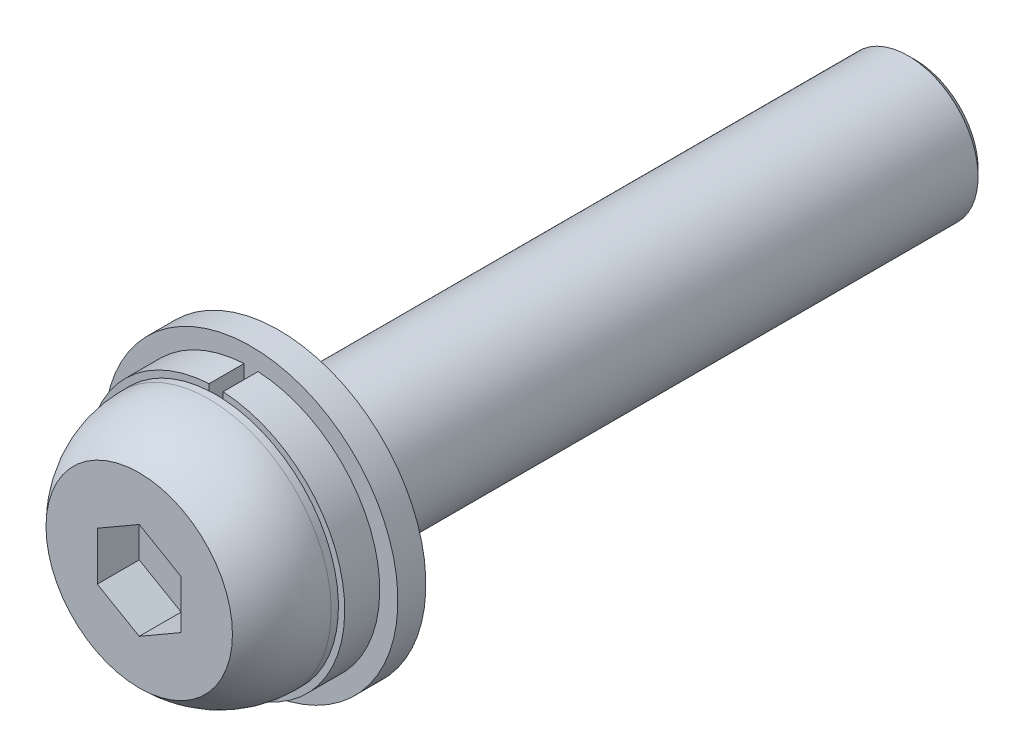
ISO-10303-21;
HEADER;
FILE_DESCRIPTION(('STEP AP214'),'2;1');
FILE_NAME('part.step','',(''),(''),'','','');
FILE_SCHEMA(('AUTOMOTIVE_DESIGN { 1 0 10303 214 1 1 1 1 }'));
ENDSEC;
DATA;
#1=APPLICATION_CONTEXT('core data for automotive mechanical design processes');
#2=APPLICATION_PROTOCOL_DEFINITION('international standard','automotive_design',2000,#1);
#3=PRODUCT_CONTEXT('',#1,'mechanical');
#4=PRODUCT('Part','Part','',(#3));
#5=PRODUCT_RELATED_PRODUCT_CATEGORY('part','',(#4));
#6=PRODUCT_DEFINITION_FORMATION('','',#4);
#7=PRODUCT_DEFINITION_CONTEXT('part definition',#1,'design');
#8=PRODUCT_DEFINITION('design','',#6,#7);
#9=PRODUCT_DEFINITION_SHAPE('','',#8);
#10=(LENGTH_UNIT() NAMED_UNIT(*) SI_UNIT(.MILLI.,.METRE.));
#11=(NAMED_UNIT(*) PLANE_ANGLE_UNIT() SI_UNIT($,.RADIAN.));
#12=(NAMED_UNIT(*) SI_UNIT($,.STERADIAN.) SOLID_ANGLE_UNIT());
#13=UNCERTAINTY_MEASURE_WITH_UNIT(LENGTH_MEASURE(1.E-05),#10,'distance_accuracy_value','');
#14=(GEOMETRIC_REPRESENTATION_CONTEXT(3) GLOBAL_UNCERTAINTY_ASSIGNED_CONTEXT((#13)) GLOBAL_UNIT_ASSIGNED_CONTEXT((#10,
#11,#12)) REPRESENTATION_CONTEXT('',''));
#15=CARTESIAN_POINT('',(0.,0.,0.));
#16=DIRECTION('',(0.,0.,1.));
#17=DIRECTION('',(1.,0.,0.));
#18=AXIS2_PLACEMENT_3D('',#15,#16,#17);
#19=CARTESIAN_POINT('',(0.,0.,2.));
#20=DIRECTION('',(0.,0.,1.));
#21=DIRECTION('',(-1.,0.,0.));
#22=AXIS2_PLACEMENT_3D('',#19,#20,#21);
#23=PLANE('',#22);
#24=DIRECTION('',(0.,1.,0.));
#25=VECTOR('',#24,1.);
#26=CARTESIAN_POINT('',(-0.5,5.07543101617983,2.));
#27=LINE('',#26,#25);
#28=CARTESIAN_POINT('',(-0.5,5.22613624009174,2.));
#29=VERTEX_POINT('',#28);
#30=CARTESIAN_POINT('',(-0.5,9.18640299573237,2.));
#31=VERTEX_POINT('',#30);
#32=EDGE_CURVE('E9',#29,#31,#27,.T.);
#33=ORIENTED_EDGE('',*,*,#32,.F.);
#34=CARTESIAN_POINT('',(0.,0.,2.));
#35=DIRECTION('',(0.,0.,1.));
#36=DIRECTION('',(-1.,0.,0.));
#37=AXIS2_PLACEMENT_3D('',#34,#35,#36);
#38=CIRCLE('',#37,5.25);
#39=CARTESIAN_POINT('',(0.5,5.22613624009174,2.));
#40=VERTEX_POINT('',#39);
#41=EDGE_CURVE('E184',#40,#29,#38,.T.);
#42=ORIENTED_EDGE('',*,*,#41,.F.);
#43=DIRECTION('',(0.,-1.,0.));
#44=VECTOR('',#43,1.);
#45=CARTESIAN_POINT('',(0.5,5.07543101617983,2.));
#46=LINE('',#45,#44);
#47=CARTESIAN_POINT('',(0.5,9.18640299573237,2.));
#48=VERTEX_POINT('',#47);
#49=EDGE_CURVE('E167',#48,#40,#46,.T.);
#50=ORIENTED_EDGE('',*,*,#49,.F.);
#51=CARTESIAN_POINT('',(0.,0.,2.));
#52=DIRECTION('',(0.,0.,1.));
#53=DIRECTION('',(1.,0.,0.));
#54=AXIS2_PLACEMENT_3D('',#51,#52,#53);
#55=CIRCLE('',#54,9.2);
#56=EDGE_CURVE('E24',#31,#48,#55,.T.);
#57=ORIENTED_EDGE('',*,*,#56,.F.);
#58=EDGE_LOOP('',(#33,#42,#50,#57));
#59=FACE_BOUND('',#58,.T.);
#60=CARTESIAN_POINT('',(0.,0.,2.));
#61=DIRECTION('',(0.,0.,1.));
#62=DIRECTION('',(-1.,0.,0.));
#63=AXIS2_PLACEMENT_3D('',#60,#61,#62);
#64=CIRCLE('',#63,10.5);
#65=CARTESIAN_POINT('',(-10.5,0.,2.));
#66=VERTEX_POINT('',#65);
#67=EDGE_CURVE('E175',#66,#66,#64,.T.);
#68=ORIENTED_EDGE('',*,*,#67,.T.);
#69=EDGE_LOOP('',(#68));
#70=FACE_BOUND('',#69,.T.);
#71=ADVANCED_FACE('F14',(#59,#70),#23,.T.);
#72=CARTESIAN_POINT('',(0.,0.,0.));
#73=DIRECTION('',(0.,0.,1.));
#74=DIRECTION('',(-1.,0.,0.));
#75=AXIS2_PLACEMENT_3D('',#72,#73,#74);
#76=PLANE('',#75);
#77=CARTESIAN_POINT('',(0.,0.,0.));
#78=DIRECTION('',(0.,0.,1.));
#79=DIRECTION('',(-1.,0.,0.));
#80=AXIS2_PLACEMENT_3D('',#77,#78,#79);
#81=CIRCLE('',#80,10.5);
#82=CARTESIAN_POINT('',(-10.5,0.,0.));
#83=VERTEX_POINT('',#82);
#84=EDGE_CURVE('E179',#83,#83,#81,.T.);
#85=ORIENTED_EDGE('',*,*,#84,.F.);
#86=EDGE_LOOP('',(#85));
#87=FACE_BOUND('',#86,.T.);
#88=CARTESIAN_POINT('',(0.,0.,0.));
#89=DIRECTION('',(0.,0.,1.));
#90=DIRECTION('',(-1.,0.,0.));
#91=AXIS2_PLACEMENT_3D('',#88,#89,#90);
#92=CIRCLE('',#91,5.25);
#93=CARTESIAN_POINT('',(-5.25,0.,0.));
#94=VERTEX_POINT('',#93);
#95=EDGE_CURVE('E187',#94,#94,#92,.T.);
#96=ORIENTED_EDGE('',*,*,#95,.T.);
#97=EDGE_LOOP('',(#96));
#98=FACE_BOUND('',#97,.T.);
#99=ADVANCED_FACE('F300',(#87,#98),#76,.F.);
#100=CARTESIAN_POINT('',(0.,0.,2.));
#101=DIRECTION('',(0.,0.,-1.));
#102=DIRECTION('',(1.,0.,0.));
#103=AXIS2_PLACEMENT_3D('',#100,#101,#102);
#104=CYLINDRICAL_SURFACE('',#103,10.5);
#105=ORIENTED_EDGE('',*,*,#67,.F.);
#106=EDGE_LOOP('',(#105));
#107=FACE_BOUND('',#106,.T.);
#108=ORIENTED_EDGE('',*,*,#84,.T.);
#109=EDGE_LOOP('',(#108));
#110=FACE_BOUND('',#109,.T.);
#111=ADVANCED_FACE('F296',(#107,#110),#104,.T.);
#112=CARTESIAN_POINT('',(0.,0.,2.));
#113=DIRECTION('',(0.,0.,-1.));
#114=DIRECTION('',(1.,0.,0.));
#115=AXIS2_PLACEMENT_3D('',#112,#113,#114);
#116=CYLINDRICAL_SURFACE('',#115,5.25);
#117=ORIENTED_EDGE('',*,*,#41,.T.);
#118=EDGE_CURVE('E337',#29,#40,#38,.T.);
#119=ORIENTED_EDGE('',*,*,#118,.T.);
#120=EDGE_LOOP('',(#117,#119));
#121=FACE_BOUND('',#120,.T.);
#122=ORIENTED_EDGE('',*,*,#95,.F.);
#123=EDGE_LOOP('',(#122));
#124=FACE_BOUND('',#123,.T.);
#125=ADVANCED_FACE('F289',(#121,#124),#116,.F.);
#126=CARTESIAN_POINT('',(3.,-5.19615242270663,7.));
#127=DIRECTION('',(0.,0.,1.));
#128=DIRECTION('',(-1.,0.,0.));
#129=AXIS2_PLACEMENT_3D('',#126,#127,#128);
#130=PLANE('',#129);
#131=DIRECTION('',(0.866025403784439,-0.5,0.));
#132=VECTOR('',#131,1.);
#133=CARTESIAN_POINT('',(-3.,-1.73205080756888,7.));
#134=LINE('',#133,#132);
#135=CARTESIAN_POINT('',(-3.,-1.73205080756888,7.));
#136=VERTEX_POINT('',#135);
#137=CARTESIAN_POINT('',(0.,-3.46410161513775,7.));
#138=VERTEX_POINT('',#137);
#139=EDGE_CURVE('E104',#136,#138,#134,.T.);
#140=ORIENTED_EDGE('',*,*,#139,.T.);
#141=DIRECTION('',(0.866025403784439,0.5,0.));
#142=VECTOR('',#141,1.);
#143=CARTESIAN_POINT('',(0.,-3.46410161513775,7.));
#144=LINE('',#143,#142);
#145=CARTESIAN_POINT('',(3.,-1.73205080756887,7.));
#146=VERTEX_POINT('',#145);
#147=EDGE_CURVE('E230',#138,#146,#144,.T.);
#148=ORIENTED_EDGE('',*,*,#147,.T.);
#149=DIRECTION('',(0.,1.,0.));
#150=VECTOR('',#149,1.);
#151=CARTESIAN_POINT('',(3.,-1.73205080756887,7.));
#152=LINE('',#151,#150);
#153=CARTESIAN_POINT('',(3.,1.73205080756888,7.));
#154=VERTEX_POINT('',#153);
#155=EDGE_CURVE('E233',#146,#154,#152,.T.);
#156=ORIENTED_EDGE('',*,*,#155,.T.);
#157=DIRECTION('',(-0.866025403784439,0.5,0.));
#158=VECTOR('',#157,1.);
#159=CARTESIAN_POINT('',(3.,1.73205080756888,7.));
#160=LINE('',#159,#158);
#161=CARTESIAN_POINT('',(0.,3.46410161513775,7.));
#162=VERTEX_POINT('',#161);
#163=EDGE_CURVE('E236',#154,#162,#160,.T.);
#164=ORIENTED_EDGE('',*,*,#163,.T.);
#165=DIRECTION('',(-0.866025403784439,-0.5,0.));
#166=VECTOR('',#165,1.);
#167=CARTESIAN_POINT('',(0.,3.46410161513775,7.));
#168=LINE('',#167,#166);
#169=CARTESIAN_POINT('',(-3.,1.73205080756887,7.));
#170=VERTEX_POINT('',#169);
#171=EDGE_CURVE('E238',#162,#170,#168,.T.);
#172=ORIENTED_EDGE('',*,*,#171,.T.);
#173=DIRECTION('',(0.,-1.,0.));
#174=VECTOR('',#173,1.);
#175=CARTESIAN_POINT('',(-3.,1.73205080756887,7.));
#176=LINE('',#175,#174);
#177=EDGE_CURVE('E129',#170,#136,#176,.T.);
#178=ORIENTED_EDGE('',*,*,#177,.T.);
#179=EDGE_LOOP('',(#140,#148,#156,#164,#172,#178));
#180=FACE_BOUND('',#179,.T.);
#181=ADVANCED_FACE('F242',(#180),#130,.T.);
#182=CARTESIAN_POINT('',(3.,-1.73205080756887,7.));
#183=DIRECTION('',(1.,0.,0.));
#184=DIRECTION('',(0.,1.,0.));
#185=AXIS2_PLACEMENT_3D('',#182,#183,#184);
#186=PLANE('',#185);
#187=DIRECTION('',(0.,1.,0.));
#188=VECTOR('',#187,1.);
#189=CARTESIAN_POINT('',(3.,-1.73205080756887,10.));
#190=LINE('',#189,#188);
#191=CARTESIAN_POINT('',(3.,-1.73205080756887,10.));
#192=VERTEX_POINT('',#191);
#193=CARTESIAN_POINT('',(3.,1.73205080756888,10.));
#194=VERTEX_POINT('',#193);
#195=EDGE_CURVE('E126',#192,#194,#190,.T.);
#196=ORIENTED_EDGE('',*,*,#195,.T.);
#197=DIRECTION('',(0.,0.,1.));
#198=VECTOR('',#197,1.);
#199=CARTESIAN_POINT('',(3.,1.73205080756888,7.));
#200=LINE('',#199,#198);
#201=EDGE_CURVE('E141',#154,#194,#200,.T.);
#202=ORIENTED_EDGE('',*,*,#201,.F.);
#203=ORIENTED_EDGE('',*,*,#155,.F.);
#204=DIRECTION('',(0.,0.,1.));
#205=VECTOR('',#204,1.);
#206=CARTESIAN_POINT('',(3.,-1.73205080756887,7.));
#207=LINE('',#206,#205);
#208=EDGE_CURVE('E143',#146,#192,#207,.T.);
#209=ORIENTED_EDGE('',*,*,#208,.T.);
#210=EDGE_LOOP('',(#196,#202,#203,#209));
#211=FACE_BOUND('',#210,.T.);
#212=ADVANCED_FACE('F248',(#211),#186,.F.);
#213=CARTESIAN_POINT('',(3.,1.73205080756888,7.));
#214=DIRECTION('',(0.5,0.866025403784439,0.));
#215=DIRECTION('',(-0.866025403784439,0.5,0.));
#216=AXIS2_PLACEMENT_3D('',#213,#214,#215);
#217=PLANE('',#216);
#218=DIRECTION('',(-0.866025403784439,0.5,0.));
#219=VECTOR('',#218,1.);
#220=CARTESIAN_POINT('',(3.,1.73205080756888,10.));
#221=LINE('',#220,#219);
#222=CARTESIAN_POINT('',(0.,3.46410161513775,10.));
#223=VERTEX_POINT('',#222);
#224=EDGE_CURVE('E134',#194,#223,#221,.T.);
#225=ORIENTED_EDGE('',*,*,#224,.T.);
#226=DIRECTION('',(0.,0.,1.));
#227=VECTOR('',#226,1.);
#228=CARTESIAN_POINT('',(0.,3.46410161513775,7.));
#229=LINE('',#228,#227);
#230=EDGE_CURVE('E139',#162,#223,#229,.T.);
#231=ORIENTED_EDGE('',*,*,#230,.F.);
#232=ORIENTED_EDGE('',*,*,#163,.F.);
#233=ORIENTED_EDGE('',*,*,#201,.T.);
#234=EDGE_LOOP('',(#225,#231,#232,#233));
#235=FACE_BOUND('',#234,.T.);
#236=ADVANCED_FACE('F252',(#235),#217,.F.);
#237=CARTESIAN_POINT('',(0.,3.46410161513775,7.));
#238=DIRECTION('',(-0.5,0.866025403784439,0.));
#239=DIRECTION('',(-0.866025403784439,-0.5,0.));
#240=AXIS2_PLACEMENT_3D('',#237,#238,#239);
#241=PLANE('',#240);
#242=DIRECTION('',(-0.866025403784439,-0.5,0.));
#243=VECTOR('',#242,1.);
#244=CARTESIAN_POINT('',(0.,3.46410161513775,10.));
#245=LINE('',#244,#243);
#246=CARTESIAN_POINT('',(-3.,1.73205080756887,10.));
#247=VERTEX_POINT('',#246);
#248=EDGE_CURVE('E117',#223,#247,#245,.T.);
#249=ORIENTED_EDGE('',*,*,#248,.T.);
#250=DIRECTION('',(0.,0.,1.));
#251=VECTOR('',#250,1.);
#252=CARTESIAN_POINT('',(-3.,1.73205080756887,7.));
#253=LINE('',#252,#251);
#254=EDGE_CURVE('E109',#170,#247,#253,.T.);
#255=ORIENTED_EDGE('',*,*,#254,.F.);
#256=ORIENTED_EDGE('',*,*,#171,.F.);
#257=ORIENTED_EDGE('',*,*,#230,.T.);
#258=EDGE_LOOP('',(#249,#255,#256,#257));
#259=FACE_BOUND('',#258,.T.);
#260=ADVANCED_FACE('F254',(#259),#241,.F.);
#261=CARTESIAN_POINT('',(-3.,1.73205080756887,7.));
#262=DIRECTION('',(-1.,0.,0.));
#263=DIRECTION('',(0.,-1.,0.));
#264=AXIS2_PLACEMENT_3D('',#261,#262,#263);
#265=PLANE('',#264);
#266=DIRECTION('',(0.,-1.,0.));
#267=VECTOR('',#266,1.);
#268=CARTESIAN_POINT('',(-3.,1.73205080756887,10.));
#269=LINE('',#268,#267);
#270=CARTESIAN_POINT('',(-3.,-1.73205080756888,10.));
#271=VERTEX_POINT('',#270);
#272=EDGE_CURVE('E112',#247,#271,#269,.T.);
#273=ORIENTED_EDGE('',*,*,#272,.T.);
#274=DIRECTION('',(0.,0.,1.));
#275=VECTOR('',#274,1.);
#276=CARTESIAN_POINT('',(-3.,-1.73205080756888,7.));
#277=LINE('',#276,#275);
#278=EDGE_CURVE('E97',#136,#271,#277,.T.);
#279=ORIENTED_EDGE('',*,*,#278,.F.);
#280=ORIENTED_EDGE('',*,*,#177,.F.);
#281=ORIENTED_EDGE('',*,*,#254,.T.);
#282=EDGE_LOOP('',(#273,#279,#280,#281));
#283=FACE_BOUND('',#282,.T.);
#284=ADVANCED_FACE('F113',(#283),#265,.F.);
#285=CARTESIAN_POINT('',(-3.,-1.73205080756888,7.));
#286=DIRECTION('',(-0.5,-0.866025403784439,0.));
#287=DIRECTION('',(0.866025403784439,-0.5,0.));
#288=AXIS2_PLACEMENT_3D('',#285,#286,#287);
#289=PLANE('',#288);
#290=DIRECTION('',(0.866025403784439,-0.5,0.));
#291=VECTOR('',#290,1.);
#292=CARTESIAN_POINT('',(-3.,-1.73205080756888,10.));
#293=LINE('',#292,#291);
#294=CARTESIAN_POINT('',(0.,-3.46410161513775,10.));
#295=VERTEX_POINT('',#294);
#296=EDGE_CURVE('E101',#271,#295,#293,.T.);
#297=ORIENTED_EDGE('',*,*,#296,.T.);
#298=DIRECTION('',(0.,0.,1.));
#299=VECTOR('',#298,1.);
#300=CARTESIAN_POINT('',(0.,-3.46410161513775,7.));
#301=LINE('',#300,#299);
#302=EDGE_CURVE('E145',#138,#295,#301,.T.);
#303=ORIENTED_EDGE('',*,*,#302,.F.);
#304=ORIENTED_EDGE('',*,*,#139,.F.);
#305=ORIENTED_EDGE('',*,*,#278,.T.);
#306=EDGE_LOOP('',(#297,#303,#304,#305));
#307=FACE_BOUND('',#306,.T.);
#308=ADVANCED_FACE('F99',(#307),#289,.F.);
#309=CARTESIAN_POINT('',(0.,-3.46410161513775,7.));
#310=DIRECTION('',(0.5,-0.866025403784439,0.));
#311=DIRECTION('',(0.866025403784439,0.5,0.));
#312=AXIS2_PLACEMENT_3D('',#309,#310,#311);
#313=PLANE('',#312);
#314=DIRECTION('',(0.866025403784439,0.5,0.));
#315=VECTOR('',#314,1.);
#316=CARTESIAN_POINT('',(0.,-3.46410161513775,10.));
#317=LINE('',#316,#315);
#318=EDGE_CURVE('E124',#295,#192,#317,.T.);
#319=ORIENTED_EDGE('',*,*,#318,.T.);
#320=ORIENTED_EDGE('',*,*,#208,.F.);
#321=ORIENTED_EDGE('',*,*,#147,.F.);
#322=ORIENTED_EDGE('',*,*,#302,.T.);
#323=EDGE_LOOP('',(#319,#320,#321,#322));
#324=FACE_BOUND('',#323,.T.);
#325=ADVANCED_FACE('F246',(#324),#313,.F.);
#326=CARTESIAN_POINT('',(0.,0.,10.));
#327=DIRECTION('',(0.,0.,-1.));
#328=DIRECTION('',(1.,0.,0.));
#329=AXIS2_PLACEMENT_3D('',#326,#327,#328);
#330=PLANE('',#329);
#331=ORIENTED_EDGE('',*,*,#318,.F.);
#332=ORIENTED_EDGE('',*,*,#296,.F.);
#333=ORIENTED_EDGE('',*,*,#272,.F.);
#334=ORIENTED_EDGE('',*,*,#248,.F.);
#335=ORIENTED_EDGE('',*,*,#224,.F.);
#336=ORIENTED_EDGE('',*,*,#195,.F.);
#337=EDGE_LOOP('',(#331,#332,#333,#334,#335,#336));
#338=FACE_BOUND('',#337,.T.);
#339=CARTESIAN_POINT('',(0.,0.,10.));
#340=DIRECTION('',(0.,0.,1.));
#341=DIRECTION('',(-1.,0.,0.));
#342=AXIS2_PLACEMENT_3D('',#339,#340,#341);
#343=CIRCLE('',#342,6.66774468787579);
#344=CARTESIAN_POINT('',(-6.66774468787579,0.,10.));
#345=VERTEX_POINT('',#344);
#346=EDGE_CURVE('E149',#345,#345,#343,.T.);
#347=ORIENTED_EDGE('',*,*,#346,.T.);
#348=EDGE_LOOP('',(#347));
#349=FACE_BOUND('',#348,.T.);
#350=ADVANCED_FACE('F120',(#338,#349),#330,.F.);
#351=CARTESIAN_POINT('',(5.,0.,-45.5));
#352=DIRECTION('',(0.,0.,1.));
#353=DIRECTION('',(-1.,0.,0.));
#354=AXIS2_PLACEMENT_3D('',#351,#352,#353);
#355=PLANE('',#354);
#356=CARTESIAN_POINT('',(0.,0.,-45.5));
#357=DIRECTION('',(0.,0.,1.));
#358=DIRECTION('',(-1.,0.,0.));
#359=AXIS2_PLACEMENT_3D('',#356,#357,#358);
#360=CIRCLE('',#359,4.5);
#361=CARTESIAN_POINT('',(-4.5,0.,-45.5));
#362=VERTEX_POINT('',#361);
#363=EDGE_CURVE('E18',#362,#362,#360,.F.);
#364=ORIENTED_EDGE('',*,*,#363,.T.);
#365=EDGE_LOOP('',(#364));
#366=FACE_BOUND('',#365,.T.);
#367=ADVANCED_FACE('F309',(#366),#355,.F.);
#368=CARTESIAN_POINT('',(0.,0.,5.01845534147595));
#369=DIRECTION('',(0.,0.,1.));
#370=DIRECTION('',(-1.,0.,0.));
#371=AXIS2_PLACEMENT_3D('',#368,#369,#370);
#372=DEGENERATE_TOROIDAL_SURFACE('',#371,1.75,7.,.T.);
#373=ORIENTED_EDGE('',*,*,#346,.F.);
#374=EDGE_LOOP('',(#373));
#375=FACE_BOUND('',#374,.T.);
#376=CARTESIAN_POINT('',(0.,0.,5.01845534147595));
#377=DIRECTION('',(0.,0.,1.));
#378=DIRECTION('',(-1.,0.,0.));
#379=AXIS2_PLACEMENT_3D('',#376,#377,#378);
#380=CIRCLE('',#379,8.75);
#381=CARTESIAN_POINT('',(-8.75,0.,5.01845534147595));
#382=VERTEX_POINT('',#381);
#383=EDGE_CURVE('E152',#382,#382,#380,.T.);
#384=ORIENTED_EDGE('',*,*,#383,.T.);
#385=EDGE_LOOP('',(#384));
#386=FACE_BOUND('',#385,.T.);
#387=ADVANCED_FACE('F311',(#375,#386),#372,.T.);
#388=CARTESIAN_POINT('',(0.,0.,-45.));
#389=DIRECTION('',(0.,0.,1.));
#390=DIRECTION('',(-1.,0.,0.));
#391=AXIS2_PLACEMENT_3D('',#388,#389,#390);
#392=CONICAL_SURFACE('',#391,5.,0.785398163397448);
#393=ORIENTED_EDGE('',*,*,#363,.F.);
#394=EDGE_LOOP('',(#393));
#395=FACE_BOUND('',#394,.T.);
#396=CARTESIAN_POINT('',(0.,0.,-45.));
#397=DIRECTION('',(0.,0.,1.));
#398=DIRECTION('',(-1.,0.,0.));
#399=AXIS2_PLACEMENT_3D('',#396,#397,#398);
#400=CIRCLE('',#399,5.);
#401=CARTESIAN_POINT('',(-5.,0.,-45.));
#402=VERTEX_POINT('',#401);
#403=EDGE_CURVE('E157',#402,#402,#400,.T.);
#404=ORIENTED_EDGE('',*,*,#403,.F.);
#405=EDGE_LOOP('',(#404));
#406=FACE_BOUND('',#405,.T.);
#407=ADVANCED_FACE('F16',(#395,#406),#392,.T.);
#408=CARTESIAN_POINT('',(0.,0.,10.));
#409=DIRECTION('',(0.,0.,1.));
#410=DIRECTION('',(-1.,0.,0.));
#411=AXIS2_PLACEMENT_3D('',#408,#409,#410);
#412=CYLINDRICAL_SURFACE('',#411,8.75);
#413=ORIENTED_EDGE('',*,*,#383,.F.);
#414=EDGE_LOOP('',(#413));
#415=FACE_BOUND('',#414,.T.);
#416=CARTESIAN_POINT('',(0.,0.,4.5));
#417=DIRECTION('',(0.,0.,1.));
#418=DIRECTION('',(-1.,0.,0.));
#419=AXIS2_PLACEMENT_3D('',#416,#417,#418);
#420=CIRCLE('',#419,8.75);
#421=CARTESIAN_POINT('',(0.5,8.73570260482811,4.5));
#422=VERTEX_POINT('',#421);
#423=CARTESIAN_POINT('',(-0.5,8.73570260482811,4.5));
#424=VERTEX_POINT('',#423);
#425=EDGE_CURVE('E155',#422,#424,#420,.T.);
#426=ORIENTED_EDGE('',*,*,#425,.T.);
#427=CARTESIAN_POINT('',(0.,0.,4.5));
#428=DIRECTION('',(0.,0.,1.));
#429=DIRECTION('',(-1.,0.,0.));
#430=AXIS2_PLACEMENT_3D('',#427,#428,#429);
#431=CIRCLE('',#430,8.75);
#432=EDGE_CURVE('E216',#422,#424,#431,.F.);
#433=ORIENTED_EDGE('',*,*,#432,.F.);
#434=EDGE_LOOP('',(#426,#433));
#435=FACE_BOUND('',#434,.T.);
#436=ADVANCED_FACE('F280',(#415,#435),#412,.T.);
#437=CARTESIAN_POINT('',(0.,0.,10.));
#438=DIRECTION('',(0.,0.,1.));
#439=DIRECTION('',(-1.,0.,0.));
#440=AXIS2_PLACEMENT_3D('',#437,#438,#439);
#441=CYLINDRICAL_SURFACE('',#440,5.);
#442=ORIENTED_EDGE('',*,*,#403,.T.);
#443=EDGE_LOOP('',(#442));
#444=FACE_BOUND('',#443,.T.);
#445=CARTESIAN_POINT('',(0.,0.,4.5));
#446=DIRECTION('',(0.,0.,1.));
#447=DIRECTION('',(-1.,0.,0.));
#448=AXIS2_PLACEMENT_3D('',#445,#446,#447);
#449=CIRCLE('',#448,5.);
#450=CARTESIAN_POINT('',(-5.,0.,4.5));
#451=VERTEX_POINT('',#450);
#452=EDGE_CURVE('E108',#451,#451,#449,.T.);
#453=ORIENTED_EDGE('',*,*,#452,.F.);
#454=EDGE_LOOP('',(#453));
#455=FACE_BOUND('',#454,.T.);
#456=ADVANCED_FACE('F287',(#444,#455),#441,.T.);
#457=CARTESIAN_POINT('',(0.,0.,4.5));
#458=DIRECTION('',(0.,0.,-1.));
#459=DIRECTION('',(-1.,0.,0.));
#460=AXIS2_PLACEMENT_3D('',#457,#458,#459);
#461=CYLINDRICAL_SURFACE('',#460,9.2);
#462=ORIENTED_EDGE('',*,*,#56,.T.);
#463=DIRECTION('',(0.,0.,-1.));
#464=VECTOR('',#463,1.);
#465=CARTESIAN_POINT('',(0.5,9.18640299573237,4.5));
#466=LINE('',#465,#464);
#467=CARTESIAN_POINT('',(0.5,9.18640299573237,4.5));
#468=VERTEX_POINT('',#467);
#469=EDGE_CURVE('E222',#468,#48,#466,.T.);
#470=ORIENTED_EDGE('',*,*,#469,.F.);
#471=CARTESIAN_POINT('',(0.,0.,4.5));
#472=DIRECTION('',(0.,0.,1.));
#473=DIRECTION('',(1.,0.,0.));
#474=AXIS2_PLACEMENT_3D('',#471,#472,#473);
#475=CIRCLE('',#474,9.2);
#476=CARTESIAN_POINT('',(-0.5,9.18640299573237,4.5));
#477=VERTEX_POINT('',#476);
#478=EDGE_CURVE('E190',#477,#468,#475,.T.);
#479=ORIENTED_EDGE('',*,*,#478,.F.);
#480=DIRECTION('',(0.,0.,-1.));
#481=VECTOR('',#480,1.);
#482=CARTESIAN_POINT('',(-0.5,9.18640299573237,4.5));
#483=LINE('',#482,#481);
#484=EDGE_CURVE('E202',#477,#31,#483,.T.);
#485=ORIENTED_EDGE('',*,*,#484,.T.);
#486=EDGE_LOOP('',(#462,#470,#479,#485));
#487=FACE_BOUND('',#486,.T.);
#488=ADVANCED_FACE('F221',(#487),#461,.T.);
#489=CARTESIAN_POINT('',(0.,0.,4.5));
#490=DIRECTION('',(0.,0.,1.));
#491=DIRECTION('',(1.,0.,0.));
#492=AXIS2_PLACEMENT_3D('',#489,#490,#491);
#493=PLANE('',#492);
#494=DIRECTION('',(0.,-1.,0.));
#495=VECTOR('',#494,1.);
#496=CARTESIAN_POINT('',(0.5,5.07543101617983,4.5));
#497=LINE('',#496,#495);
#498=EDGE_CURVE('E194',#468,#422,#497,.T.);
#499=ORIENTED_EDGE('',*,*,#498,.T.);
#500=ORIENTED_EDGE('',*,*,#432,.T.);
#501=DIRECTION('',(0.,1.,0.));
#502=VECTOR('',#501,1.);
#503=CARTESIAN_POINT('',(-0.5,5.07543101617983,4.5));
#504=LINE('',#503,#502);
#505=EDGE_CURVE('E200',#424,#477,#504,.T.);
#506=ORIENTED_EDGE('',*,*,#505,.T.);
#507=ORIENTED_EDGE('',*,*,#478,.T.);
#508=EDGE_LOOP('',(#499,#500,#506,#507));
#509=FACE_BOUND('',#508,.T.);
#510=ADVANCED_FACE('F212',(#509),#493,.T.);
#511=CARTESIAN_POINT('',(5.,0.,4.5));
#512=DIRECTION('',(0.,0.,1.));
#513=DIRECTION('',(-1.,0.,0.));
#514=AXIS2_PLACEMENT_3D('',#511,#512,#513);
#515=PLANE('',#514);
#516=ORIENTED_EDGE('',*,*,#452,.T.);
#517=EDGE_LOOP('',(#516));
#518=FACE_BOUND('',#517,.T.);
#519=ORIENTED_EDGE('',*,*,#425,.F.);
#520=CARTESIAN_POINT('',(0.5,5.07543101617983,4.5));
#521=VERTEX_POINT('',#520);
#522=EDGE_CURVE('E193',#422,#521,#497,.T.);
#523=ORIENTED_EDGE('',*,*,#522,.T.);
#524=CARTESIAN_POINT('',(0.,0.,4.5));
#525=DIRECTION('',(0.,0.,-1.));
#526=DIRECTION('',(1.,0.,0.));
#527=AXIS2_PLACEMENT_3D('',#524,#525,#526);
#528=CIRCLE('',#527,5.1);
#529=CARTESIAN_POINT('',(-0.5,5.07543101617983,4.5));
#530=VERTEX_POINT('',#529);
#531=EDGE_CURVE('E197',#521,#530,#528,.T.);
#532=ORIENTED_EDGE('',*,*,#531,.T.);
#533=EDGE_CURVE('E201',#530,#424,#504,.T.);
#534=ORIENTED_EDGE('',*,*,#533,.T.);
#535=EDGE_LOOP('',(#519,#523,#532,#534));
#536=FACE_BOUND('',#535,.T.);
#537=ADVANCED_FACE('F268',(#518,#536),#515,.F.);
#538=CARTESIAN_POINT('',(0.,0.,4.5));
#539=DIRECTION('',(0.,0.,-1.));
#540=DIRECTION('',(-1.,0.,0.));
#541=AXIS2_PLACEMENT_3D('',#538,#539,#540);
#542=CYLINDRICAL_SURFACE('',#541,5.1);
#543=CARTESIAN_POINT('',(0.,0.,2.));
#544=DIRECTION('',(0.,0.,-1.));
#545=DIRECTION('',(1.,0.,0.));
#546=AXIS2_PLACEMENT_3D('',#543,#544,#545);
#547=CIRCLE('',#546,5.1);
#548=CARTESIAN_POINT('',(0.5,5.07543101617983,2.));
#549=VERTEX_POINT('',#548);
#550=CARTESIAN_POINT('',(-0.5,5.07543101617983,2.));
#551=VERTEX_POINT('',#550);
#552=EDGE_CURVE('E165',#549,#551,#547,.T.);
#553=ORIENTED_EDGE('',*,*,#552,.T.);
#554=DIRECTION('',(0.,0.,-1.));
#555=VECTOR('',#554,1.);
#556=CARTESIAN_POINT('',(-0.5,5.07543101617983,4.5));
#557=LINE('',#556,#555);
#558=EDGE_CURVE('E207',#530,#551,#557,.T.);
#559=ORIENTED_EDGE('',*,*,#558,.F.);
#560=ORIENTED_EDGE('',*,*,#531,.F.);
#561=DIRECTION('',(0.,0.,-1.));
#562=VECTOR('',#561,1.);
#563=CARTESIAN_POINT('',(0.5,5.07543101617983,4.5));
#564=LINE('',#563,#562);
#565=EDGE_CURVE('E223',#521,#549,#564,.T.);
#566=ORIENTED_EDGE('',*,*,#565,.T.);
#567=EDGE_LOOP('',(#553,#559,#560,#566));
#568=FACE_BOUND('',#567,.T.);
#569=ADVANCED_FACE('F265',(#568),#542,.F.);
#570=CARTESIAN_POINT('',(0.,0.,2.));
#571=DIRECTION('',(0.,0.,1.));
#572=DIRECTION('',(1.,0.,0.));
#573=AXIS2_PLACEMENT_3D('',#570,#571,#572);
#574=PLANE('',#573);
#575=ORIENTED_EDGE('',*,*,#118,.F.);
#576=EDGE_CURVE('E26',#551,#29,#27,.T.);
#577=ORIENTED_EDGE('',*,*,#576,.F.);
#578=ORIENTED_EDGE('',*,*,#552,.F.);
#579=EDGE_CURVE('E162',#40,#549,#46,.T.);
#580=ORIENTED_EDGE('',*,*,#579,.F.);
#581=EDGE_LOOP('',(#575,#577,#578,#580));
#582=FACE_BOUND('',#581,.T.);
#583=ADVANCED_FACE('F267',(#582),#574,.F.);
#584=CARTESIAN_POINT('',(0.5,5.07543101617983,4.5));
#585=DIRECTION('',(1.,0.,0.));
#586=DIRECTION('',(0.,1.,0.));
#587=AXIS2_PLACEMENT_3D('',#584,#585,#586);
#588=PLANE('',#587);
#589=ORIENTED_EDGE('',*,*,#49,.T.);
#590=ORIENTED_EDGE('',*,*,#579,.T.);
#591=ORIENTED_EDGE('',*,*,#565,.F.);
#592=ORIENTED_EDGE('',*,*,#522,.F.);
#593=ORIENTED_EDGE('',*,*,#498,.F.);
#594=ORIENTED_EDGE('',*,*,#469,.T.);
#595=EDGE_LOOP('',(#589,#590,#591,#592,#593,#594));
#596=FACE_BOUND('',#595,.T.);
#597=ADVANCED_FACE('F276',(#596),#588,.F.);
#598=CARTESIAN_POINT('',(-0.5,5.07543101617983,4.5));
#599=DIRECTION('',(-1.,0.,0.));
#600=DIRECTION('',(0.,-1.,0.));
#601=AXIS2_PLACEMENT_3D('',#598,#599,#600);
#602=PLANE('',#601);
#603=ORIENTED_EDGE('',*,*,#576,.T.);
#604=ORIENTED_EDGE('',*,*,#32,.T.);
#605=ORIENTED_EDGE('',*,*,#484,.F.);
#606=ORIENTED_EDGE('',*,*,#505,.F.);
#607=ORIENTED_EDGE('',*,*,#533,.F.);
#608=ORIENTED_EDGE('',*,*,#558,.T.);
#609=EDGE_LOOP('',(#603,#604,#605,#606,#607,#608));
#610=FACE_BOUND('',#609,.T.);
#611=ADVANCED_FACE('F219',(#610),#602,.F.);
#612=CLOSED_SHELL('',(#71,#99,#111,#125,#181,#212,#236,#260,#284,#308,#325,#350,#367,#387,#407,
#436,#456,#488,#510,#537,#569,#583,#597,#611));
#613=MANIFOLD_SOLID_BREP('B1',#612);
#614=ADVANCED_BREP_SHAPE_REPRESENTATION('',(#18,#613),#14);
#615=SHAPE_DEFINITION_REPRESENTATION(#9,#614);
ENDSEC;
END-ISO-10303-21;
